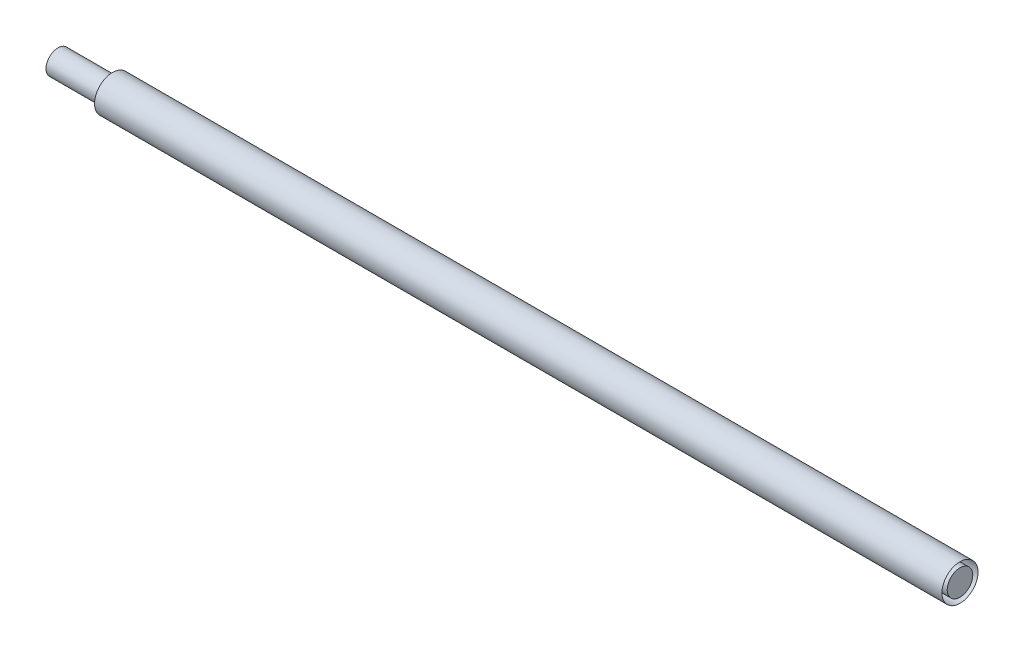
ISO-10303-21;
HEADER;
FILE_DESCRIPTION(('STEP AP214'),'2;1');
FILE_NAME('part.step','',(''),(''),'','','');
FILE_SCHEMA(('AUTOMOTIVE_DESIGN { 1 0 10303 214 1 1 1 1 }'));
ENDSEC;
DATA;
#1=APPLICATION_CONTEXT('core data for automotive mechanical design processes');
#2=APPLICATION_PROTOCOL_DEFINITION('international standard','automotive_design',2000,#1);
#3=PRODUCT_CONTEXT('',#1,'mechanical');
#4=PRODUCT('Part','Part','',(#3));
#5=PRODUCT_RELATED_PRODUCT_CATEGORY('part','',(#4));
#6=PRODUCT_DEFINITION_FORMATION('','',#4);
#7=PRODUCT_DEFINITION_CONTEXT('part definition',#1,'design');
#8=PRODUCT_DEFINITION('design','',#6,#7);
#9=PRODUCT_DEFINITION_SHAPE('','',#8);
#10=(LENGTH_UNIT() NAMED_UNIT(*) SI_UNIT(.MILLI.,.METRE.));
#11=(NAMED_UNIT(*) PLANE_ANGLE_UNIT() SI_UNIT($,.RADIAN.));
#12=(NAMED_UNIT(*) SI_UNIT($,.STERADIAN.) SOLID_ANGLE_UNIT());
#13=UNCERTAINTY_MEASURE_WITH_UNIT(LENGTH_MEASURE(1.E-05),#10,'distance_accuracy_value','');
#14=(GEOMETRIC_REPRESENTATION_CONTEXT(3) GLOBAL_UNCERTAINTY_ASSIGNED_CONTEXT((#13)) GLOBAL_UNIT_ASSIGNED_CONTEXT((#10,
#11,#12)) REPRESENTATION_CONTEXT('',''));
#15=CARTESIAN_POINT('',(0.,0.,0.));
#16=DIRECTION('',(0.,0.,1.));
#17=DIRECTION('',(1.,0.,0.));
#18=AXIS2_PLACEMENT_3D('',#15,#16,#17);
#19=CARTESIAN_POINT('',(-150.,0.,0.));
#20=DIRECTION('',(1.,0.,0.));
#21=DIRECTION('',(0.,0.,-1.));
#22=AXIS2_PLACEMENT_3D('',#19,#20,#21);
#23=PLANE('',#22);
#24=CARTESIAN_POINT('',(-150.,0.,0.));
#25=DIRECTION('',(1.,0.,0.));
#26=DIRECTION('',(0.,0.,-1.));
#27=AXIS2_PLACEMENT_3D('',#24,#25,#26);
#28=CIRCLE('',#27,4.);
#29=CARTESIAN_POINT('',(-150.,0.,-4.));
#30=VERTEX_POINT('',#29);
#31=EDGE_CURVE('P0_E18',#30,#30,#28,.T.);
#32=ORIENTED_EDGE('',*,*,#31,.F.);
#33=EDGE_LOOP('',(#32));
#34=FACE_BOUND('',#33,.T.);
#35=ADVANCED_FACE('P0_F15',(#34),#23,.F.);
#36=CARTESIAN_POINT('',(-150.9072168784,0.,0.));
#37=DIRECTION('',(1.,0.,0.));
#38=DIRECTION('',(0.,0.,-1.));
#39=AXIS2_PLACEMENT_3D('',#36,#37,#38);
#40=CYLINDRICAL_SURFACE('',#39,4.);
#41=CARTESIAN_POINT('',(-132.000000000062,0.,0.));
#42=DIRECTION('',(1.,0.,0.));
#43=DIRECTION('',(0.,0.,1.));
#44=AXIS2_PLACEMENT_3D('',#41,#42,#43);
#45=CIRCLE('',#44,3.99999999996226);
#46=CARTESIAN_POINT('',(-132.000000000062,0.,3.99999999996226));
#47=VERTEX_POINT('',#46);
#48=EDGE_CURVE('P0_E30',#47,#47,#45,.T.);
#49=ORIENTED_EDGE('',*,*,#48,.F.);
#50=EDGE_LOOP('',(#49));
#51=FACE_BOUND('',#50,.T.);
#52=ORIENTED_EDGE('',*,*,#31,.T.);
#53=EDGE_LOOP('',(#52));
#54=FACE_BOUND('',#53,.T.);
#55=ADVANCED_FACE('P0_F38',(#51,#54),#40,.T.);
#56=CARTESIAN_POINT('',(150.,0.,0.));
#57=DIRECTION('',(1.,0.,0.));
#58=DIRECTION('',(0.,0.,-1.));
#59=AXIS2_PLACEMENT_3D('',#56,#57,#58);
#60=PLANE('',#59);
#61=CARTESIAN_POINT('',(150.,0.,0.));
#62=DIRECTION('',(1.,0.,0.));
#63=DIRECTION('',(0.,0.,-1.));
#64=AXIS2_PLACEMENT_3D('',#61,#62,#63);
#65=CIRCLE('',#64,4.25);
#66=CARTESIAN_POINT('',(150.,0.,-4.25));
#67=VERTEX_POINT('',#66);
#68=EDGE_CURVE('P0_E23',#67,#67,#65,.F.);
#69=ORIENTED_EDGE('',*,*,#68,.F.);
#70=EDGE_LOOP('',(#69));
#71=FACE_BOUND('',#70,.T.);
#72=ADVANCED_FACE('P0_F45',(#71),#60,.T.);
#73=CARTESIAN_POINT('',(-131.855662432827,0.,0.));
#74=DIRECTION('',(1.,0.,0.));
#75=DIRECTION('',(0.,0.,-1.));
#76=AXIS2_PLACEMENT_3D('',#73,#74,#75);
#77=CONICAL_SURFACE('',#76,4.24999999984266,1.04719755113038);
#78=ORIENTED_EDGE('',*,*,#48,.T.);
#79=EDGE_LOOP('',(#78));
#80=FACE_BOUND('',#79,.T.);
#81=CARTESIAN_POINT('',(-131.8556624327,0.,0.));
#82=DIRECTION('',(1.,0.,0.));
#83=DIRECTION('',(0.,0.,-1.));
#84=AXIS2_PLACEMENT_3D('',#81,#82,#83);
#85=CIRCLE('',#84,4.25);
#86=CARTESIAN_POINT('',(-131.8556624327,0.,-4.25));
#87=VERTEX_POINT('',#86);
#88=EDGE_CURVE('P0_E10',#87,#87,#85,.T.);
#89=ORIENTED_EDGE('',*,*,#88,.F.);
#90=EDGE_LOOP('',(#89));
#91=FACE_BOUND('',#90,.T.);
#92=ADVANCED_FACE('P0_F49',(#80,#91),#77,.T.);
#93=CARTESIAN_POINT('',(-150.,0.,0.));
#94=DIRECTION('',(1.,0.,0.));
#95=DIRECTION('',(0.,0.,-1.));
#96=AXIS2_PLACEMENT_3D('',#93,#94,#95);
#97=CYLINDRICAL_SURFACE('',#96,4.25);
#98=ORIENTED_EDGE('',*,*,#68,.T.);
#99=EDGE_LOOP('',(#98));
#100=FACE_BOUND('',#99,.T.);
#101=ORIENTED_EDGE('',*,*,#88,.T.);
#102=EDGE_LOOP('',(#101));
#103=FACE_BOUND('',#102,.T.);
#104=ADVANCED_FACE('P0_F47',(#100,#103),#97,.T.);
#105=CLOSED_SHELL('',(#35,#55,#72,#92,#104));
#106=MANIFOLD_SOLID_BREP('P0_B1',#105);
#107=CARTESIAN_POINT('',(150.,0.,0.));
#108=DIRECTION('',(-1.,0.,0.));
#109=DIRECTION('',(0.,0.,1.));
#110=AXIS2_PLACEMENT_3D('',#107,#108,#109);
#111=CYLINDRICAL_SURFACE('',#110,6.);
#112=CARTESIAN_POINT('',(-131.8556624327,0.,0.));
#113=DIRECTION('',(-1.,0.,0.));
#114=DIRECTION('',(0.,0.,1.));
#115=AXIS2_PLACEMENT_3D('',#112,#113,#114);
#116=CIRCLE('',#115,6.);
#117=CARTESIAN_POINT('',(-131.8556624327,0.,6.));
#118=VERTEX_POINT('',#117);
#119=EDGE_CURVE('P1_E21',#118,#118,#116,.F.);
#120=ORIENTED_EDGE('',*,*,#119,.T.);
#121=EDGE_LOOP('',(#120));
#122=FACE_BOUND('',#121,.T.);
#123=CARTESIAN_POINT('',(150.,0.,0.));
#124=DIRECTION('',(-1.,0.,0.));
#125=DIRECTION('',(0.,0.,1.));
#126=AXIS2_PLACEMENT_3D('',#123,#124,#125);
#127=CIRCLE('',#126,6.);
#128=CARTESIAN_POINT('',(150.,0.,6.));
#129=VERTEX_POINT('',#128);
#130=EDGE_CURVE('P1_E11',#129,#129,#127,.T.);
#131=ORIENTED_EDGE('',*,*,#130,.T.);
#132=EDGE_LOOP('',(#131));
#133=FACE_BOUND('',#132,.T.);
#134=ADVANCED_FACE('P1_F17',(#122,#133),#111,.T.);
#135=CARTESIAN_POINT('',(-131.8556624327,0.,0.));
#136=DIRECTION('',(-1.,0.,0.));
#137=DIRECTION('',(0.,0.,1.));
#138=AXIS2_PLACEMENT_3D('',#135,#136,#137);
#139=PLANE('',#138);
#140=CARTESIAN_POINT('',(-131.8556624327,-4.25,0.));
#141=CARTESIAN_POINT('',(-131.8556624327,-4.24979761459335,-0.810903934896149));
#142=CARTESIAN_POINT('',(-131.8556624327,-3.95160027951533,-1.56440251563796));
#143=CARTESIAN_POINT('',(-131.8556624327,-3.79324420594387,-1.96454384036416));
#144=CARTESIAN_POINT('',(-131.8556624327,-3.55723092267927,-2.32564145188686));
#145=CARTESIAN_POINT('',(-131.8556624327,-3.31674210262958,-2.69358658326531));
#146=CARTESIAN_POINT('',(-131.8556624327,-3.00520382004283,-3.00520382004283));
#147=CARTESIAN_POINT('',(-131.8556624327,-2.69442288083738,-3.31606352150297));
#148=CARTESIAN_POINT('',(-131.8556624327,-2.32564145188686,-3.55723092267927));
#149=CARTESIAN_POINT('',(-131.8556624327,-1.96548089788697,-3.79276063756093));
#150=CARTESIAN_POINT('',(-131.8556624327,-1.56440251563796,-3.95160027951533));
#151=CARTESIAN_POINT('',(-131.8556624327,-0.811183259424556,-4.24989877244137));
#152=CARTESIAN_POINT('',(-131.8556624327,0.,-4.25));
#153=CARTESIAN_POINT('',(-131.8556624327,0.810137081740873,-4.25010109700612));
#154=CARTESIAN_POINT('',(-131.8556624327,1.56440251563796,-3.95160027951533));
#155=CARTESIAN_POINT('',(-131.8556624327,1.96454384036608,-3.79324420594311));
#156=CARTESIAN_POINT('',(-131.8556624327,2.32564145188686,-3.55723092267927));
#157=CARTESIAN_POINT('',(-131.8556624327,2.6935865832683,-3.31674210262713));
#158=CARTESIAN_POINT('',(-131.8556624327,3.00520382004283,-3.00520382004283));
#159=CARTESIAN_POINT('',(-131.8556624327,3.31606352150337,-2.69442288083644));
#160=CARTESIAN_POINT('',(-131.8556624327,3.55723092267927,-2.32564145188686));
#161=CARTESIAN_POINT('',(-131.8556624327,3.79276063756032,-1.96548089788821));
#162=CARTESIAN_POINT('',(-131.8556624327,3.95160027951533,-1.56440251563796));
#163=CARTESIAN_POINT('',(-131.8556624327,4.24979748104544,-0.81143902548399));
#164=CARTESIAN_POINT('',(-131.8556624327,4.25,0.));
#165=B_SPLINE_CURVE_WITH_KNOTS('',2,(#140,#141,#142,#143,#144,#145,#146,#147,#148,#149,#150,
#151,#152,#153,#154,#155,#156,#157,#158,#159,#160,#161,#162,#163,#164),.UNSPECIFIED.,.F.,.F.,(3,
2,2,2,2,2,2,2,2,2,2,2,3),(0.,0.125,0.1875,0.25,0.3125,0.375,0.5,0.625,0.6875,0.75,0.8125,0.875,
1.),.UNSPECIFIED.);
#166=CARTESIAN_POINT('',(-131.8556624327,-4.25,0.));
#167=VERTEX_POINT('',#166);
#168=CARTESIAN_POINT('',(-131.8556624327,4.25,0.));
#169=VERTEX_POINT('',#168);
#170=EDGE_CURVE('P1_E34',#167,#169,#165,.T.);
#171=ORIENTED_EDGE('',*,*,#170,.T.);
#172=CARTESIAN_POINT('',(-131.8556624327,4.25,0.));
#173=CARTESIAN_POINT('',(-131.8556624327,4.24979761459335,0.810903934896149));
#174=CARTESIAN_POINT('',(-131.8556624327,3.95160027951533,1.56440251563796));
#175=CARTESIAN_POINT('',(-131.8556624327,3.79324420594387,1.96454384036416));
#176=CARTESIAN_POINT('',(-131.8556624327,3.55723092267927,2.32564145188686));
#177=CARTESIAN_POINT('',(-131.8556624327,3.31674210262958,2.69358658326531));
#178=CARTESIAN_POINT('',(-131.8556624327,3.00520382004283,3.00520382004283));
#179=CARTESIAN_POINT('',(-131.8556624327,2.69442288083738,3.31606352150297));
#180=CARTESIAN_POINT('',(-131.8556624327,2.32564145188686,3.55723092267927));
#181=CARTESIAN_POINT('',(-131.8556624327,1.96548089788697,3.79276063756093));
#182=CARTESIAN_POINT('',(-131.8556624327,1.56440251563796,3.95160027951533));
#183=CARTESIAN_POINT('',(-131.8556624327,0.811183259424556,4.24989877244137));
#184=CARTESIAN_POINT('',(-131.8556624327,0.,4.25));
#185=CARTESIAN_POINT('',(-131.8556624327,-0.810137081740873,4.25010109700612));
#186=CARTESIAN_POINT('',(-131.8556624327,-1.56440251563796,3.95160027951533));
#187=CARTESIAN_POINT('',(-131.8556624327,-1.96454384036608,3.79324420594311));
#188=CARTESIAN_POINT('',(-131.8556624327,-2.32564145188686,3.55723092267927));
#189=CARTESIAN_POINT('',(-131.8556624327,-2.6935865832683,3.31674210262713));
#190=CARTESIAN_POINT('',(-131.8556624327,-3.00520382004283,3.00520382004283));
#191=CARTESIAN_POINT('',(-131.8556624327,-3.31606352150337,2.69442288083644));
#192=CARTESIAN_POINT('',(-131.8556624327,-3.55723092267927,2.32564145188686));
#193=CARTESIAN_POINT('',(-131.8556624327,-3.79276063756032,1.96548089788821));
#194=CARTESIAN_POINT('',(-131.8556624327,-3.95160027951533,1.56440251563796));
#195=CARTESIAN_POINT('',(-131.8556624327,-4.24979748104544,0.81143902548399));
#196=CARTESIAN_POINT('',(-131.8556624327,-4.25,0.));
#197=B_SPLINE_CURVE_WITH_KNOTS('',2,(#172,#173,#174,#175,#176,#177,#178,#179,#180,#181,#182,
#183,#184,#185,#186,#187,#188,#189,#190,#191,#192,#193,#194,#195,#196),.UNSPECIFIED.,.F.,.F.,(3,
2,2,2,2,2,2,2,2,2,2,2,3),(0.,0.125,0.1875,0.25,0.3125,0.375,0.5,0.625,0.6875,0.75,0.8125,0.875,
1.),.UNSPECIFIED.);
#198=EDGE_CURVE('P1_E37',#169,#167,#197,.T.);
#199=ORIENTED_EDGE('',*,*,#198,.T.);
#200=EDGE_LOOP('',(#171,#199));
#201=FACE_BOUND('',#200,.T.);
#202=ORIENTED_EDGE('',*,*,#119,.F.);
#203=EDGE_LOOP('',(#202));
#204=FACE_BOUND('',#203,.T.);
#205=ADVANCED_FACE('P1_F18',(#201,#204),#139,.T.);
#206=OPEN_SHELL('',(#134,#205));
#207=SHELL_BASED_SURFACE_MODEL('P1_B1',(#206));
#208=ADVANCED_BREP_SHAPE_REPRESENTATION('',(#18,#106),#14);
#209=MANIFOLD_SURFACE_SHAPE_REPRESENTATION('',(#18,#207),#14);
#210=SHAPE_REPRESENTATION('',(#18),#14);
#211=SHAPE_DEFINITION_REPRESENTATION(#9,#210);
#212=SHAPE_REPRESENTATION_RELATIONSHIP('','',#210,#208);
#213=SHAPE_REPRESENTATION_RELATIONSHIP('','',#210,#209);
ENDSEC;
END-ISO-10303-21;
